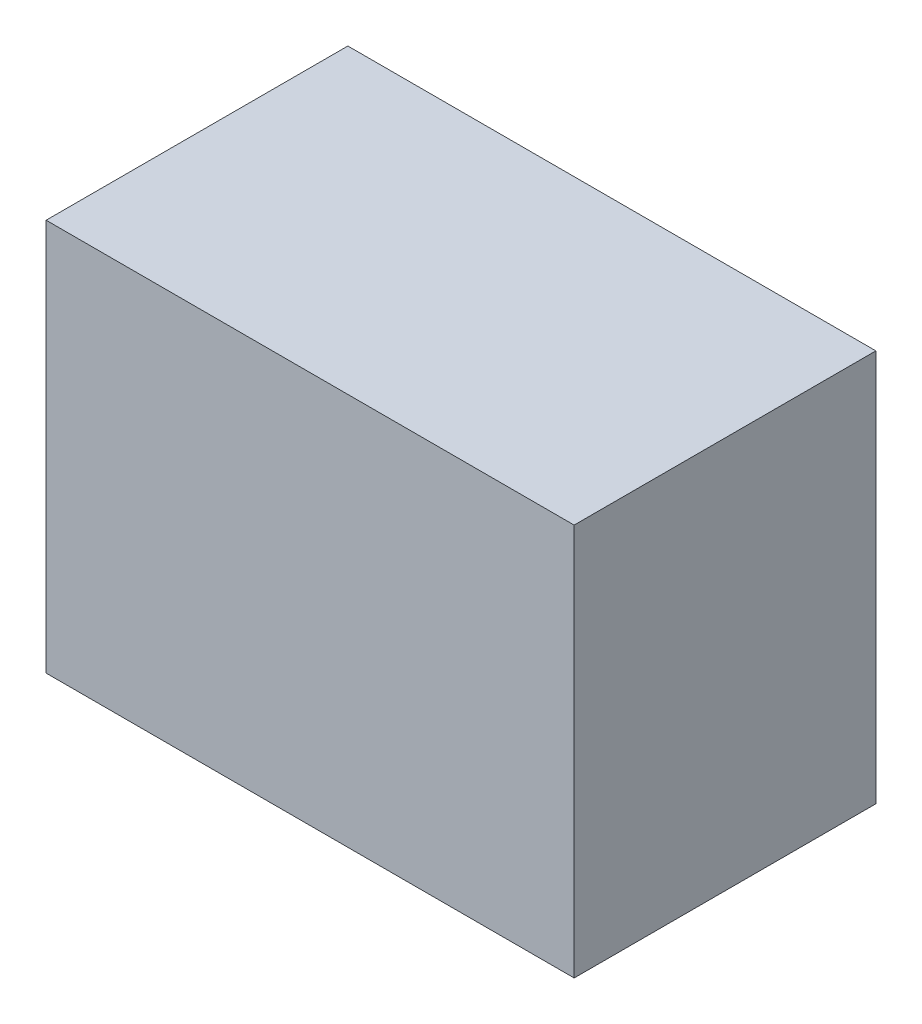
from build123d import *

# Parameters (mm, degrees)
ESQUISSE1_W                = 35
ESQUISSE1_H                = 26
EXTRUSION1_DEPTH           = 20
TROU_TARAUD_M12X1_51_D     = 10.5
TROU_TARAUD_M12X1_51_DEPTH = 26.5
TROU_TARAUD_M12X1_51_TIP   = 3.15451825


with BuildPart() as part:
    # Esquisse1 → Extrusion1 (new body)
    with BuildSketch(Plane.XY):
        with Locations((17.5, 13)):
            Rectangle(ESQUISSE1_W, ESQUISSE1_H)
    extrude(amount=EXTRUSION1_DEPTH)

    # Trou taraud_ M12x1.51
    with Locations(Plane(origin=(0, 13, 10), x_dir=(0, 0, -1), z_dir=(-1, 0, 0))):
        with Locations((0, 0)):
            Hole(TROU_TARAUD_M12X1_51_D / 2, depth=TROU_TARAUD_M12X1_51_DEPTH)
            with Locations((0, 0, -(TROU_TARAUD_M12X1_51_DEPTH + TROU_TARAUD_M12X1_51_TIP / 2))):  # 118° drill point
                Cone(0, TROU_TARAUD_M12X1_51_D / 2, TROU_TARAUD_M12X1_51_TIP, mode=Mode.SUBTRACT)


solid = part.part
